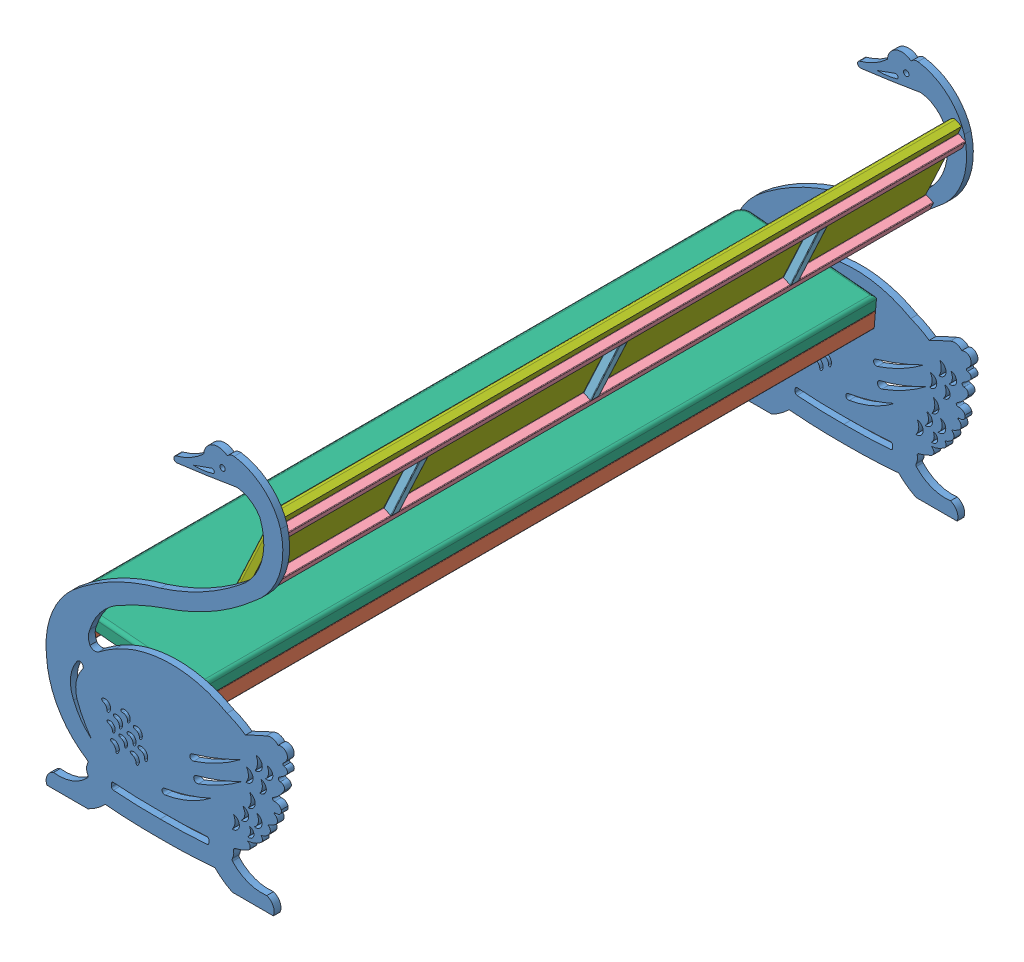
SolidWorks assembly bench_swan.SLDASM, configuration По умолчанию (file format 7000). Lengths in mm.
Overall size (713.56 1119.1 2040).
14 component instances, 7 part files, 41 mates.
Components (placement in the parent):
- Image_swan-1: Image_swan.SLDPRT [По умолчанию] at (1182.3483 356.6022 399.3437) size (713.56 1119.1 20)
- Image_swan-2: Image_swan.SLDPRT [По умолчанию] at (1182.3483 356.6022 2419.3437) size (713.56 1119.1 20)
- 50x2000-1: 50x2000.SLDPRT [По умолчанию] at (539.5884 795.1991 409.3437) x (0.996195 -0.087156 0) z (0 0 1) size (30 50 2000)
- 50x2000-2: 50x2000.SLDPRT [По умолчанию] at (210.8441 823.9604 409.3437) x (0.996195 -0.087156 0) z (0 0 1) size (30 50 2000)
- 20x300-1: 20x300.SLDPRT [По умолчанию] at (210.8441 823.9604 1989.3437) x (0 0 -1) z (0.996195 -0.087156 0) size (20 40 300)
- 20x300-2: 20x300.SLDPRT [По умолчанию] at (210.8441 823.9604 809.3437) x (0 0 -1) z (0.996195 -0.087156 0) size (20 40 300)
- 20x300-3: 20x300.SLDPRT [По умолчанию] at (210.8441 823.9604 1399.3437) x (0 0 -1) z (0.996195 -0.087156 0) size (20 40 300)
- 25x2000-1: 25x2000.SLDPRT [По умолчанию] at (806.0081 1359.9533 409.3437) x (0.906308 -0.422618 0) z (0 0 1) size (25 25 2000)
- 25x2000-2: 25x2000.SLDPRT [По умолчанию] at (710.919 1156.0341 409.3437) x (0.906308 -0.422618 0) z (0 0 1) size (25 25 2000)
- 25x200-1: 25x200.SLDPRT [По умолчанию] at (795.4426 1337.2956 831.8437) x (0.906308 -0.422618 0) z (-0.422618 -0.906308 0) size (25 25 200)
- 25x200-2: 25x200.SLDPRT [По умолчанию] at (795.4426 1337.2956 1421.8437) x (0.906308 -0.422618 0) z (-0.422618 -0.906308 0) size (25 25 200)
- 25x200-3: 25x200.SLDPRT [По умолчанию] at (795.4426 1337.2956 2011.8437) x (0.906308 -0.422618 0) z (-0.422618 -0.906308 0) size (25 25 200)
- Plank_1-1: Plank_1.SLDPRT [По умолчанию] at (141.1105 830.0614 409.3437) x (0 0 -1) z (0.087156 0.996195 0) size (2000 400 40)
- Plank_2-1: Plank_2.SLDPRT [По умолчанию] at (793.9159 1393.1765 2409.3437) x (0 0 1) z (-0.906308 0.422618 0) size (2000 300 30)
Mates (geometry in assembly coordinates):
- Концентричный1: concentric aligned: cylinder of Image_swan-1 through (631.871 478.3708 399.3437) axis (0 0 1) radius 31.6627; cylinder of Image_swan-2 through (631.871 478.3708 2419.3437) axis (0 0 1) radius 31.6627
- Совпадение2: coincident aligned: plane of 50x2000-1 through (512.4297 794.5637 2409.3437) normal (0 0 1); plane of 50x2000-2 through (183.6854 823.3251 2409.3437) normal (0 0 1)
- Совпадение3: coincident aligned: plane of 50x2000-1 through (536.5998 795.4605 2409.3437) normal (0.087156 0.996195 0); plane of 50x2000-2 through (207.8556 824.2219 2409.3437) normal (0.087156 0.996195 0)
- Совпадение4: coincident anti-aligned: plane of Image_swan-2 through (30.334 5147.5548 2409.3437) normal (0 0 -1); plane of 50x2000-1 through (512.4297 794.5637 2409.3437) normal (0 0 1)
- Совпадение5: coincident anti-aligned: plane of Image_swan-1 through (101.5763 376.3137 409.3437) normal (0 0 1); plane of 50x2000-1 through (512.4297 794.5637 409.3437) normal (0 0 -1)
- Расстояние3: distance = 300 mm anti-aligned: plane of 50x2000-1 through (509.4411 794.8251 2409.3437) normal (-0.996195 0.087156 0); plane of 50x2000-2 through (210.5827 820.9719 2409.3437) normal (0.996195 -0.087156 0)
- Совпадение11: coincident anti-aligned: plane of 50x2000-2 through (210.5827 820.9719 2409.3437) normal (0.996195 -0.087156 0); plane of 20x300-1 through (210.6698 821.9681 2007.3437) normal (-0.996195 0.087156 0)
- Совпадение12: coincident aligned: plane of 50x2000-2 through (207.8556 824.2219 2409.3437) normal (0.087156 0.996195 0); plane of 20x300-1 through (509.7026 797.8137 1991.3437) normal (0.087156 0.996195 0)
- Совпадение13: coincident anti-aligned: plane of 50x2000-2 through (210.5827 820.9719 2409.3437) normal (0.996195 -0.087156 0); plane of 20x300-2 through (210.6698 821.9681 827.3437) normal (-0.996195 0.087156 0)
- Совпадение14: coincident aligned: plane of 50x2000-2 through (207.8556 824.2219 2409.3437) normal (0.087156 0.996195 0); plane of 20x300-2 through (509.7026 797.8137 811.3437) normal (0.087156 0.996195 0)
- Совпадение15: coincident anti-aligned: plane of 50x2000-2 through (210.5827 820.9719 2409.3437) normal (0.996195 -0.087156 0); plane of 20x300-3 through (210.6698 821.9681 1417.3437) normal (-0.996195 0.087156 0)
- Совпадение16: coincident aligned: plane of 50x2000-2 through (207.8556 824.2219 2409.3437) normal (0.087156 0.996195 0); plane of 20x300-3 through (509.7026 797.8137 1401.3437) normal (0.087156 0.996195 0)
- Расстояние4: distance = 990 mm anti-aligned: plane of 20x300-3 through (509.5282 795.8213 1399.3437) normal (0 0 -1); plane of Image_swan-1 through (101.5763 376.3137 409.3437) normal (0 0 1)
- Расстояние5: distance = 400 mm anti-aligned: plane of Image_swan-1 through (101.5763 376.3137 409.3437) normal (0 0 1); plane of 20x300-2 through (509.5282 795.8213 809.3437) normal (0 0 -1)
- Расстояние6: distance = 400 mm anti-aligned: plane of 20x300-1 through (509.5282 795.8213 2009.3437) normal (0 0 1); plane of Image_swan-2 through (30.334 5147.5548 2409.3437) normal (0 0 -1)
- Совпадение20: coincident aligned: plane of 25x2000-1 through (784.3178 1367.8609 409.3437) normal (0 0 -1); plane of 25x2000-2 through (689.2287 1163.9417 409.3437) normal (0 0 -1)
- Совпадение21: coincident aligned: plane of 25x2000-1 through (782.5052 1368.7062 2409.3437) normal (-0.906308 0.422618 0); plane of 25x2000-2 through (687.4161 1164.7869 2409.3437) normal (-0.906308 0.422618 0)
- Совпадение22: coincident anti-aligned: plane of Image_swan-1 through (101.5763 376.3137 409.3437) normal (0 0 1); plane of 25x2000-2 through (689.2287 1163.9417 409.3437) normal (0 0 -1)
- Угол1: planar angle = 0.349066 rad aligned: plane of 25x2000-2 through (687.4161 1164.7869 2409.3437) normal (-0.906308 0.422618 0); plane of 50x2000-2 through (180.6968 823.5865 2409.3437) normal (-0.996195 0.087156 0)
- Совпадение23: coincident aligned: plane of Image_swan-1 through (659.3579 376.3137 399.3437) normal (0 -1 0); plane of Image_swan-2 through (659.3579 376.3137 2419.3437) normal (0 -1 0)
- Угол2: planar angle = 0.087266 rad anti-aligned: plane of 50x2000-2 through (207.8556 824.2219 2409.3437) normal (0.087156 0.996195 0); plane of Image_swan-1 through (111.4509 376.3137 399.3437) normal (0 -1 0)
- Расстояние7: distance = 450 mm: line of 50x2000-2 through (183.9469 826.3137 2409.3437) axis (0 0 -1); plane of Image_swan-1 through (111.4509 376.3137 399.3437) normal (0 -1 0)
- Расстояние9: distance = 30 mm: plane of 50x2000-2 through (180.6968 823.5865 2409.3437) normal (-0.996195 0.087156 0); line of Image_swan-1 through (111.4509 376.3137 409.3437) axis (0 0 -1)
- Касательность1: tangent aligned: cylinder of Image_swan-1 through (231.2964 1710.467 399.3437) axis (0 0 1) radius 743; cylinder of 25x2000-2 through (699.3862 1136.0342 2409.3437) axis (0 0 -1) radius 2
- Совпадение28: coincident anti-aligned: plane of 25x2000-2 through (709.1064 1156.8793 2409.3437) normal (0.422618 0.906308 0); plane of 25x200-3 through (690.0739 1165.7543 2009.8437) normal (-0.422618 -0.906308 0)
- Совпадение29: coincident aligned: plane of 25x2000-2 through (710.0738 1154.2215 2409.3437) normal (0.906308 -0.422618 0); plane of 25x200-3 through (710.919 1156.0341 2009.8437) normal (0.906308 -0.422618 0)
- Совпадение30: coincident anti-aligned: plane of 25x2000-2 through (709.1064 1156.8793 2409.3437) normal (0.422618 0.906308 0); plane of 25x200-2 through (690.0739 1165.7543 1419.8437) normal (-0.422618 -0.906308 0)
- Совпадение31: coincident aligned: plane of 25x2000-2 through (710.0738 1154.2215 2409.3437) normal (0.906308 -0.422618 0); plane of 25x200-2 through (710.919 1156.0341 1419.8437) normal (0.906308 -0.422618 0)
- Совпадение32: coincident anti-aligned: plane of 25x2000-2 through (709.1064 1156.8793 2409.3437) normal (0.422618 0.906308 0); plane of 25x200-1 through (690.0739 1165.7543 829.8437) normal (-0.422618 -0.906308 0)
- Совпадение33: coincident aligned: plane of 25x2000-2 through (710.0738 1154.2215 2409.3437) normal (0.906308 -0.422618 0); plane of 25x200-1 through (710.919 1156.0341 829.8437) normal (0.906308 -0.422618 0)
- Ширина1: width anti-aligned: plane of 25x200-2 through (709.1064 1156.8793 1421.8437) normal (0 0 1); plane of 25x200-2 through (709.1064 1156.8793 1396.8437) normal (0 0 -1); plane of 20x300-3 through (509.5282 795.8213 1399.3437) normal (0 0 -1); plane of 20x300-3 through (509.5282 795.8213 1419.3437) normal (0 0 1)
- Ширина2: width anti-aligned: plane of 25x200-1 through (709.1064 1156.8793 831.8437) normal (0 0 1); plane of 25x200-1 through (709.1064 1156.8793 806.8437) normal (0 0 -1); plane of 20x300-2 through (509.5282 795.8213 809.3437) normal (0 0 -1); plane of 20x300-2 through (509.5282 795.8213 829.3437) normal (0 0 1)
- Ширина3: width anti-aligned: plane of 25x200-3 through (709.1064 1156.8793 2011.8437) normal (0 0 1); plane of 25x200-3 through (709.1064 1156.8793 1986.8437) normal (0 0 -1); plane of 20x300-1 through (509.5282 795.8213 1989.3437) normal (0 0 -1); plane of 20x300-1 through (509.5282 795.8213 2009.3437) normal (0 0 1)
- Касательность2: tangent: circle of Image_swan-1; cylinder of 25x2000-1 through (803.3502 1358.986 2409.3437) axis (0 0 -1) radius 2
- Совпадение35: coincident anti-aligned: plane of 25x2000-1 through (793.63 1338.1409 2409.3437) normal (-0.422618 -0.906308 0); plane of 25x200-1 through (774.5976 1347.0159 829.8437) normal (0.422618 0.906308 0)
- Совпадение36: coincident anti-aligned: plane of 50x2000-2 through (207.8556 824.2219 2409.3437) normal (0.087156 0.996195 0); plane of Plank_1-1 through (141.1105 830.0614 409.3437) normal (-0.087156 -0.996195 0)
- Совпадение37: coincident anti-aligned: plane of Image_swan-2 through (30.334 5147.5548 2409.3437) normal (0 0 -1); plane of Plank_1-1 through (144.5967 869.9091 2409.3437) normal (0 0 1)
- Совпадение38: coincident anti-aligned: plane of 25x2000-2 through (687.4161 1164.7869 2409.3437) normal (-0.906308 0.422618 0); plane of Plank_2-1 through (793.9159 1393.1765 2409.3437) normal (0.906308 -0.422618 0)
- Совпадение39: coincident anti-aligned: plane of Image_swan-2 through (30.334 5147.5548 2409.3437) normal (0 0 -1); plane of Plank_2-1 through (766.7266 1405.855 2409.3437) normal (0 0 1)
- Ширина4: width anti-aligned: plane of 25x2000-1 through (804.1955 1360.7986 2409.3437) normal (0.422618 0.906308 0); plane of 25x2000-2 through (698.5409 1134.2216 2409.3437) normal (-0.422618 -0.906308 0); plane of Plank_2-1 through (639.9412 1133.9627 2409.3437) normal (-0.422618 -0.906308 0); plane of Plank_2-1 through (766.7266 1405.855 2409.3437) normal (0.422618 0.906308 0)
- Совпадение40: coincident aligned: plane of 50x2000-1 through (539.3269 792.2105 2409.3437) normal (0.996195 -0.087156 0); plane of Plank_1-1 through (543.0746 835.0468 409.3437) normal (0.996195 -0.087156 0)
